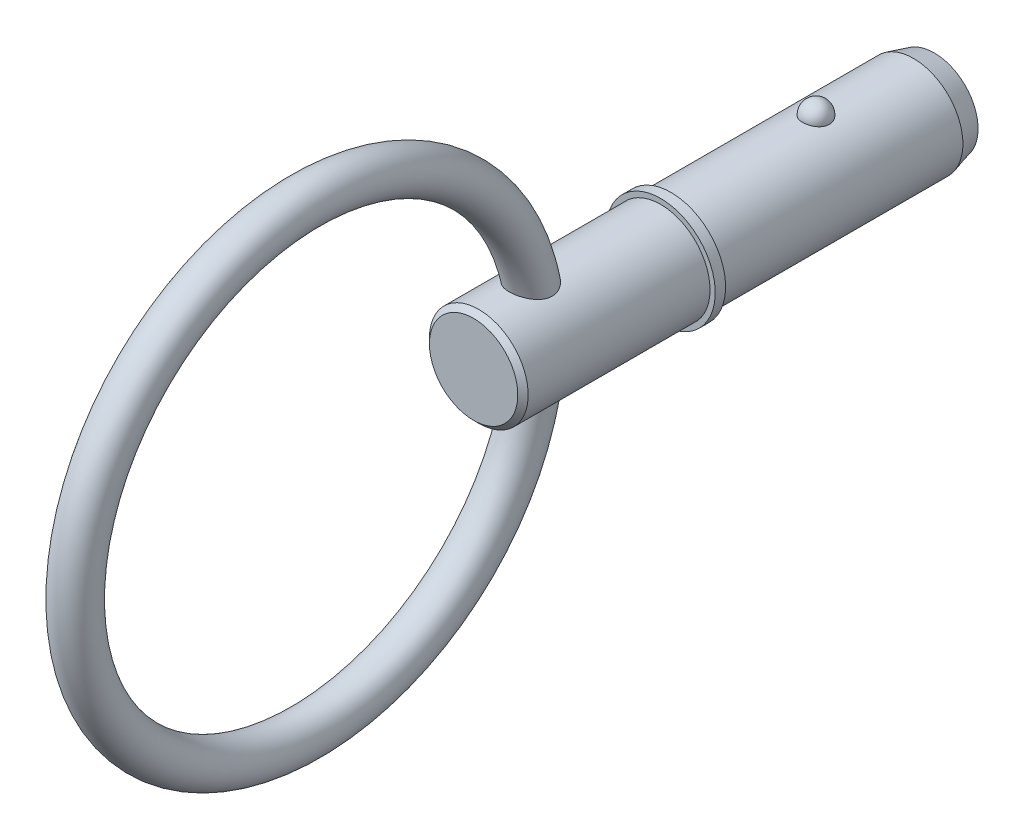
from build123d import *

# Parameters (mm, degrees)
SKETCH2_R           = 4.765
BOSS_EXTRUDE1_DEPTH = 12.7
BOSS_EXTRUDE2_START = 12.7
SKETCH3_R           = 4.765
BOSS_EXTRUDE2_DEPTH = 12.7
CHAMFER1_SIZE       = 2
CHAMFER1_SIZE2      = 0.535898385
SKETCH20_W          = 1
SKETCH20_H          = 5.265
SKETCH21_R          = 4.765
BOSS_EXTRUDE3_DEPTH = 19.05
CHAMFER2_SIZE       = 0.5
SKETCH24_R          = 2


with BuildPart() as part:
    # Sketch2 → Boss-Extrude1 (new body)
    with BuildSketch(Plane.XY):
        Circle(SKETCH2_R)
    extrude(amount=BOSS_EXTRUDE1_DEPTH)

    # Sketch3 → Boss-Extrude2 (add)
    with BuildSketch(Plane(origin=(0, 0, 0), x_dir=(-1, 0, 0), z_dir=(0, 0, -1)).offset(BOSS_EXTRUDE2_START)):
        Circle(SKETCH3_R)
    extrude(amount=-BOSS_EXTRUDE2_DEPTH)

    # Chamfer1
    chamfer1_edges = [part.edges().sort_by_distance(p)[0] for p in [
        (4.765, 0, -12.7),
    ]]
    chamfer1_side = [part.faces().sort_by_distance(p)[0] for p in [
        (4.765, 0, -6.35),
    ]]
    chamfer(chamfer1_edges, length=CHAMFER1_SIZE, length2=CHAMFER1_SIZE2, reference=chamfer1_side[0])

    # Sketch18 → Revolve1 (revolve)
    with BuildSketch(Plane(origin=(0, 0, 0), x_dir=(0, 0, -1), z_dir=(1, 0, 0))):
        with BuildLine():
            Line((1.29, 6.055), (1.29, 3.475))
            ThreePointArc((1.29, 3.475), (0, 4.765), (1.29, 6.055))
        make_face()
    revolve(axis=Axis((0, 6.055, -1.29), (0, -1, 0)))

    # Sketch20 → Revolve2 (revolve)
    with BuildSketch(Plane(origin=(0, 0, 0), x_dir=(0, 0, -1), z_dir=(1, 0, 0)), mode=Mode.PRIVATE) as revolve2_sk:
        with Locations((-13.2, 2.6325)):
            Rectangle(SKETCH20_W, SKETCH20_H)
    revolve(revolve2_sk.sketch.rotate(Axis((0, 0, 33.728787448), (0, 0, 1)), 90), axis=Axis((0, 0, 33.728787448), (0, 0, 1)))

    # Sketch21 → Boss-Extrude3 (add)
    with BuildSketch(Plane(origin=(0, 0, 12.7), x_dir=(-1, 0, 0), z_dir=(0, 0, -1))):
        Circle(SKETCH21_R)
    extrude(amount=-BOSS_EXTRUDE3_DEPTH)

    # Chamfer2
    chamfer2_edges = [part.edges().sort_by_distance(p)[0] for p in [
        (4.765, 0, 31.75),
    ]]
    chamfer(chamfer2_edges, length=CHAMFER2_SIZE)

    # Sweep1: sweep along a path in Sketch23
    with BuildLine(Plane(origin=(0, 0, 0), x_dir=(0, 0, -1), z_dir=(1, 0, 0))) as sweep1_path:
        CenterArc((-47.975, 0), 22.225, 0, 360)
    # Sketch24 → Sweep1 (sweep)
    with BuildSketch(Plane(origin=(0, 0, 0), x_dir=(1, 0, 0), z_dir=(0, 1, 0))):
        with Locations((0, -25.75)):
            Circle(SKETCH24_R)
    sweep(path=sweep1_path.line)


solid = part.part
